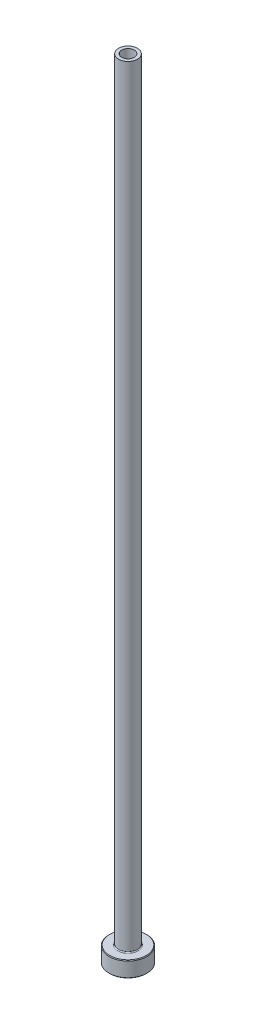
from build123d import *

# Parameters (mm, degrees)
FILLET1_R     = 0.3
CHAMFER1_SIZE = 0.2
CHAMFER3_SIZE = 0.5


with BuildPart() as part:
    # Sketch1 → Revolve1 (revolve)
    with BuildSketch(Plane.XY, mode=Mode.PRIVATE) as revolve1_sk:
        Polygon((-2, 250), (-3, 250), (-3, 5), (-6, 5), (-6, 0), (-2.25, 0), (-2.25, 193), (-2, 205), align=None)
    revolve(revolve1_sk.sketch.rotate(Axis((0, 92.187680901, 0), (0, -1, 0)), 270), axis=Axis((0, 92.187680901, 0), (0, -1, 0)))

    # Fillet1
    fillet1_edges = [part.edges().sort_by_distance(p)[0] for p in [
        (0, 5, -3),
    ]]
    fillet(fillet1_edges, radius=FILLET1_R)

    # Chamfer1
    chamfer1_edges = [part.edges().sort_by_distance(p)[0] for p in [
        (0, 0, -6),
        (0, 5, -6),
    ]]
    chamfer(chamfer1_edges, length=CHAMFER1_SIZE)

    # Chamfer3
    chamfer3_edges = [part.edges().sort_by_distance(p)[0] for p in [
        (0, 0, -2.25),
    ]]
    chamfer(chamfer3_edges, length=CHAMFER3_SIZE)


solid = part.part
